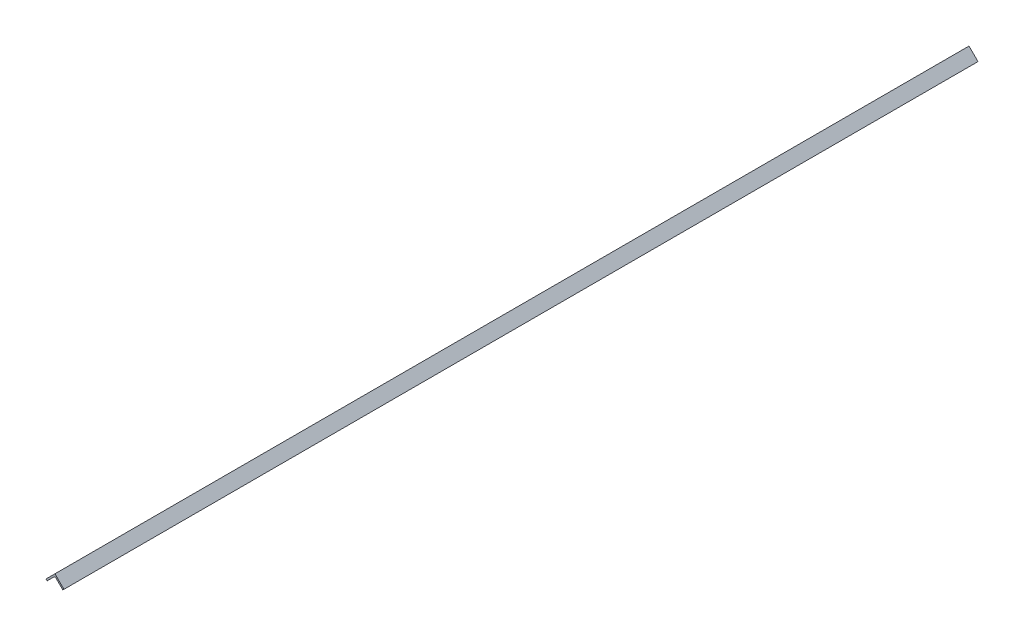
ISO-10303-21;
HEADER;
FILE_DESCRIPTION(('STEP AP214'),'2;1');
FILE_NAME('part.step','',(''),(''),'','','');
FILE_SCHEMA(('AUTOMOTIVE_DESIGN { 1 0 10303 214 1 1 1 1 }'));
ENDSEC;
DATA;
#1=APPLICATION_CONTEXT('core data for automotive mechanical design processes');
#2=APPLICATION_PROTOCOL_DEFINITION('international standard','automotive_design',2000,#1);
#3=PRODUCT_CONTEXT('',#1,'mechanical');
#4=PRODUCT('Part','Part','',(#3));
#5=PRODUCT_RELATED_PRODUCT_CATEGORY('part','',(#4));
#6=PRODUCT_DEFINITION_FORMATION('','',#4);
#7=PRODUCT_DEFINITION_CONTEXT('part definition',#1,'design');
#8=PRODUCT_DEFINITION('design','',#6,#7);
#9=PRODUCT_DEFINITION_SHAPE('','',#8);
#10=(LENGTH_UNIT() NAMED_UNIT(*) SI_UNIT(.MILLI.,.METRE.));
#11=(NAMED_UNIT(*) PLANE_ANGLE_UNIT() SI_UNIT($,.RADIAN.));
#12=(NAMED_UNIT(*) SI_UNIT($,.STERADIAN.) SOLID_ANGLE_UNIT());
#13=UNCERTAINTY_MEASURE_WITH_UNIT(LENGTH_MEASURE(1.E-05),#10,'distance_accuracy_value','');
#14=(GEOMETRIC_REPRESENTATION_CONTEXT(3) GLOBAL_UNCERTAINTY_ASSIGNED_CONTEXT((#13)) GLOBAL_UNIT_ASSIGNED_CONTEXT((#10,
#11,#12)) REPRESENTATION_CONTEXT('',''));
#15=CARTESIAN_POINT('',(0.,0.,0.));
#16=DIRECTION('',(0.,0.,1.));
#17=DIRECTION('',(1.,0.,0.));
#18=AXIS2_PLACEMENT_3D('',#15,#16,#17);
#19=CARTESIAN_POINT('',(0.,0.,-1828.8));
#20=DIRECTION('',(-0.707106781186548,0.707106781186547,0.));
#21=DIRECTION('',(-0.707106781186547,-0.707106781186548,0.));
#22=AXIS2_PLACEMENT_3D('',#19,#20,#21);
#23=PLANE('',#22);
#24=DIRECTION('',(-0.707106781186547,-0.707106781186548,0.));
#25=VECTOR('',#24,1.);
#26=CARTESIAN_POINT('',(0.,0.,0.));
#27=LINE('',#26,#25);
#28=CARTESIAN_POINT('',(0.,0.,0.));
#29=VERTEX_POINT('',#28);
#30=CARTESIAN_POINT('',(-17.9605122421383,-17.9605122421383,0.));
#31=VERTEX_POINT('',#30);
#32=EDGE_CURVE('E124',#29,#31,#27,.T.);
#33=ORIENTED_EDGE('',*,*,#32,.F.);
#34=DIRECTION('',(0.,0.,1.));
#35=VECTOR('',#34,1.);
#36=CARTESIAN_POINT('',(0.,0.,-1828.8));
#37=LINE('',#36,#35);
#38=CARTESIAN_POINT('',(0.,0.,-1828.8));
#39=VERTEX_POINT('',#38);
#40=EDGE_CURVE('E11',#39,#29,#37,.T.);
#41=ORIENTED_EDGE('',*,*,#40,.F.);
#42=DIRECTION('',(-0.707106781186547,-0.707106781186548,0.));
#43=VECTOR('',#42,1.);
#44=CARTESIAN_POINT('',(0.,0.,-1828.8));
#45=LINE('',#44,#43);
#46=CARTESIAN_POINT('',(-17.9605122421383,-17.9605122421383,-1828.8));
#47=VERTEX_POINT('',#46);
#48=EDGE_CURVE('E141',#39,#47,#45,.T.);
#49=ORIENTED_EDGE('',*,*,#48,.T.);
#50=DIRECTION('',(0.,0.,1.));
#51=VECTOR('',#50,1.);
#52=CARTESIAN_POINT('',(-17.9605122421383,-17.9605122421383,-1828.8));
#53=LINE('',#52,#51);
#54=EDGE_CURVE('E36',#47,#31,#53,.T.);
#55=ORIENTED_EDGE('',*,*,#54,.T.);
#56=EDGE_LOOP('',(#33,#41,#49,#55));
#57=FACE_BOUND('',#56,.T.);
#58=ADVANCED_FACE('F33',(#57),#23,.T.);
#59=CARTESIAN_POINT('',(0.,0.,-1828.8));
#60=DIRECTION('',(0.707106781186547,0.707106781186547,0.));
#61=DIRECTION('',(-0.707106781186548,0.707106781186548,0.));
#62=AXIS2_PLACEMENT_3D('',#59,#60,#61);
#63=PLANE('',#62);
#64=DIRECTION('',(-0.707106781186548,0.707106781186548,0.));
#65=VECTOR('',#64,1.);
#66=CARTESIAN_POINT('',(0.,0.,0.));
#67=LINE('',#66,#65);
#68=CARTESIAN_POINT('',(17.9605122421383,-17.9605122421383,0.));
#69=VERTEX_POINT('',#68);
#70=EDGE_CURVE('E139',#69,#29,#67,.T.);
#71=ORIENTED_EDGE('',*,*,#70,.F.);
#72=DIRECTION('',(0.,0.,1.));
#73=VECTOR('',#72,1.);
#74=CARTESIAN_POINT('',(17.9605122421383,-17.9605122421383,-1828.8));
#75=LINE('',#74,#73);
#76=CARTESIAN_POINT('',(17.9605122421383,-17.9605122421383,-1828.8));
#77=VERTEX_POINT('',#76);
#78=EDGE_CURVE('E42',#77,#69,#75,.T.);
#79=ORIENTED_EDGE('',*,*,#78,.F.);
#80=DIRECTION('',(-0.707106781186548,0.707106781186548,0.));
#81=VECTOR('',#80,1.);
#82=CARTESIAN_POINT('',(0.,0.,-1828.8));
#83=LINE('',#82,#81);
#84=EDGE_CURVE('E114',#77,#39,#83,.T.);
#85=ORIENTED_EDGE('',*,*,#84,.T.);
#86=ORIENTED_EDGE('',*,*,#40,.T.);
#87=EDGE_LOOP('',(#71,#79,#85,#86));
#88=FACE_BOUND('',#87,.T.);
#89=ADVANCED_FACE('F151',(#88),#63,.T.);
#90=CARTESIAN_POINT('',(15.715448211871,-20.2055762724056,-1828.8));
#91=DIRECTION('',(0.707106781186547,-0.707106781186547,0.));
#92=DIRECTION('',(0.707106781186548,0.707106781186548,0.));
#93=AXIS2_PLACEMENT_3D('',#90,#91,#92);
#94=PLANE('',#93);
#95=DIRECTION('',(0.707106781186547,0.707106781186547,0.));
#96=VECTOR('',#95,1.);
#97=CARTESIAN_POINT('',(15.715448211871,-20.2055762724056,0.));
#98=LINE('',#97,#96);
#99=CARTESIAN_POINT('',(15.715448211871,-20.2055762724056,0.));
#100=VERTEX_POINT('',#99);
#101=EDGE_CURVE('E101',#100,#69,#98,.T.);
#102=ORIENTED_EDGE('',*,*,#101,.F.);
#103=DIRECTION('',(0.,0.,1.));
#104=VECTOR('',#103,1.);
#105=CARTESIAN_POINT('',(15.715448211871,-20.2055762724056,-1828.8));
#106=LINE('',#105,#104);
#107=CARTESIAN_POINT('',(15.715448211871,-20.2055762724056,-1828.8));
#108=VERTEX_POINT('',#107);
#109=EDGE_CURVE('E96',#108,#100,#106,.T.);
#110=ORIENTED_EDGE('',*,*,#109,.F.);
#111=DIRECTION('',(0.707106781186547,0.707106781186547,0.));
#112=VECTOR('',#111,1.);
#113=CARTESIAN_POINT('',(15.715448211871,-20.2055762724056,-1828.8));
#114=LINE('',#113,#112);
#115=EDGE_CURVE('E99',#108,#77,#114,.T.);
#116=ORIENTED_EDGE('',*,*,#115,.T.);
#117=ORIENTED_EDGE('',*,*,#78,.T.);
#118=EDGE_LOOP('',(#102,#110,#116,#117));
#119=FACE_BOUND('',#118,.T.);
#120=ADVANCED_FACE('F98',(#119),#94,.T.);
#121=CARTESIAN_POINT('',(1.79605122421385,-6.28617928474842,-1828.8));
#122=DIRECTION('',(-0.707106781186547,-0.707106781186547,0.));
#123=DIRECTION('',(0.707106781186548,-0.707106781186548,0.));
#124=AXIS2_PLACEMENT_3D('',#121,#122,#123);
#125=PLANE('',#124);
#126=DIRECTION('',(0.707106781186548,-0.707106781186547,0.));
#127=VECTOR('',#126,1.);
#128=CARTESIAN_POINT('',(1.79605122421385,-6.28617928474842,0.));
#129=LINE('',#128,#127);
#130=CARTESIAN_POINT('',(1.79605122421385,-6.28617928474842,0.));
#131=VERTEX_POINT('',#130);
#132=EDGE_CURVE('E136',#131,#100,#129,.T.);
#133=ORIENTED_EDGE('',*,*,#132,.F.);
#134=DIRECTION('',(0.,0.,1.));
#135=VECTOR('',#134,1.);
#136=CARTESIAN_POINT('',(1.79605122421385,-6.28617928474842,-1828.8));
#137=LINE('',#136,#135);
#138=CARTESIAN_POINT('',(1.79605122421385,-6.28617928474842,-1828.8));
#139=VERTEX_POINT('',#138);
#140=EDGE_CURVE('E106',#139,#131,#137,.T.);
#141=ORIENTED_EDGE('',*,*,#140,.F.);
#142=DIRECTION('',(0.707106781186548,-0.707106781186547,0.));
#143=VECTOR('',#142,1.);
#144=CARTESIAN_POINT('',(1.79605122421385,-6.28617928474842,-1828.8));
#145=LINE('',#144,#143);
#146=EDGE_CURVE('E112',#139,#108,#145,.T.);
#147=ORIENTED_EDGE('',*,*,#146,.T.);
#148=ORIENTED_EDGE('',*,*,#109,.T.);
#149=EDGE_LOOP('',(#133,#141,#147,#148));
#150=FACE_BOUND('',#149,.T.);
#151=ADVANCED_FACE('F116',(#150),#125,.T.);
#152=CARTESIAN_POINT('',(0.,-8.08223050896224,-1828.8));
#153=DIRECTION('',(0.,0.,1.));
#154=DIRECTION('',(1.,0.,0.));
#155=AXIS2_PLACEMENT_3D('',#152,#153,#154);
#156=CYLINDRICAL_SURFACE('',#155,2.54);
#157=CARTESIAN_POINT('',(0.,-8.08223050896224,0.));
#158=DIRECTION('',(0.,0.,-1.));
#159=DIRECTION('',(-1.,0.,0.));
#160=AXIS2_PLACEMENT_3D('',#157,#158,#159);
#161=CIRCLE('',#160,2.54);
#162=CARTESIAN_POINT('',(-1.79605122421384,-6.28617928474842,0.));
#163=VERTEX_POINT('',#162);
#164=EDGE_CURVE('E133',#163,#131,#161,.T.);
#165=ORIENTED_EDGE('',*,*,#164,.F.);
#166=DIRECTION('',(0.,0.,1.));
#167=VECTOR('',#166,1.);
#168=CARTESIAN_POINT('',(-1.79605122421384,-6.28617928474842,-1828.8));
#169=LINE('',#168,#167);
#170=CARTESIAN_POINT('',(-1.79605122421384,-6.28617928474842,-1828.8));
#171=VERTEX_POINT('',#170);
#172=EDGE_CURVE('E145',#171,#163,#169,.T.);
#173=ORIENTED_EDGE('',*,*,#172,.F.);
#174=CARTESIAN_POINT('',(0.,-8.08223050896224,-1828.8));
#175=DIRECTION('',(0.,0.,-1.));
#176=DIRECTION('',(-1.,0.,0.));
#177=AXIS2_PLACEMENT_3D('',#174,#175,#176);
#178=CIRCLE('',#177,2.54);
#179=EDGE_CURVE('E117',#171,#139,#178,.T.);
#180=ORIENTED_EDGE('',*,*,#179,.T.);
#181=ORIENTED_EDGE('',*,*,#140,.T.);
#182=EDGE_LOOP('',(#165,#173,#180,#181));
#183=FACE_BOUND('',#182,.T.);
#184=ADVANCED_FACE('F164',(#183),#156,.F.);
#185=CARTESIAN_POINT('',(-15.715448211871,-20.2055762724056,-1828.8));
#186=DIRECTION('',(0.707106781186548,-0.707106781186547,0.));
#187=DIRECTION('',(0.707106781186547,0.707106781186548,0.));
#188=AXIS2_PLACEMENT_3D('',#185,#186,#187);
#189=PLANE('',#188);
#190=DIRECTION('',(0.707106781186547,0.707106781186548,0.));
#191=VECTOR('',#190,1.);
#192=CARTESIAN_POINT('',(-15.715448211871,-20.2055762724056,0.));
#193=LINE('',#192,#191);
#194=CARTESIAN_POINT('',(-15.715448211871,-20.2055762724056,0.));
#195=VERTEX_POINT('',#194);
#196=EDGE_CURVE('E130',#195,#163,#193,.T.);
#197=ORIENTED_EDGE('',*,*,#196,.F.);
#198=DIRECTION('',(0.,0.,1.));
#199=VECTOR('',#198,1.);
#200=CARTESIAN_POINT('',(-15.715448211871,-20.2055762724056,-1828.8));
#201=LINE('',#200,#199);
#202=CARTESIAN_POINT('',(-15.715448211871,-20.2055762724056,-1828.8));
#203=VERTEX_POINT('',#202);
#204=EDGE_CURVE('E146',#203,#195,#201,.T.);
#205=ORIENTED_EDGE('',*,*,#204,.F.);
#206=DIRECTION('',(0.707106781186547,0.707106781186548,0.));
#207=VECTOR('',#206,1.);
#208=CARTESIAN_POINT('',(-15.715448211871,-20.2055762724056,-1828.8));
#209=LINE('',#208,#207);
#210=EDGE_CURVE('E119',#203,#171,#209,.T.);
#211=ORIENTED_EDGE('',*,*,#210,.T.);
#212=ORIENTED_EDGE('',*,*,#172,.T.);
#213=EDGE_LOOP('',(#197,#205,#211,#212));
#214=FACE_BOUND('',#213,.T.);
#215=ADVANCED_FACE('F167',(#214),#189,.T.);
#216=CARTESIAN_POINT('',(-17.9605122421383,-17.9605122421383,-1828.8));
#217=DIRECTION('',(-0.707106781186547,-0.707106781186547,0.));
#218=DIRECTION('',(0.707106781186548,-0.707106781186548,0.));
#219=AXIS2_PLACEMENT_3D('',#216,#217,#218);
#220=PLANE('',#219);
#221=DIRECTION('',(0.707106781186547,-0.707106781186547,0.));
#222=VECTOR('',#221,1.);
#223=CARTESIAN_POINT('',(-17.9605122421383,-17.9605122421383,0.));
#224=LINE('',#223,#222);
#225=EDGE_CURVE('E127',#31,#195,#224,.T.);
#226=ORIENTED_EDGE('',*,*,#225,.F.);
#227=ORIENTED_EDGE('',*,*,#54,.F.);
#228=DIRECTION('',(0.707106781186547,-0.707106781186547,0.));
#229=VECTOR('',#228,1.);
#230=CARTESIAN_POINT('',(-17.9605122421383,-17.9605122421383,-1828.8));
#231=LINE('',#230,#229);
#232=EDGE_CURVE('E229',#47,#203,#231,.T.);
#233=ORIENTED_EDGE('',*,*,#232,.T.);
#234=ORIENTED_EDGE('',*,*,#204,.T.);
#235=EDGE_LOOP('',(#226,#227,#233,#234));
#236=FACE_BOUND('',#235,.T.);
#237=ADVANCED_FACE('F148',(#236),#220,.T.);
#238=CARTESIAN_POINT('',(0.,-8.08223050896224,-1828.8));
#239=DIRECTION('',(0.,0.,-1.));
#240=DIRECTION('',(-1.,0.,0.));
#241=AXIS2_PLACEMENT_3D('',#238,#239,#240);
#242=PLANE('',#241);
#243=ORIENTED_EDGE('',*,*,#48,.F.);
#244=ORIENTED_EDGE('',*,*,#84,.F.);
#245=ORIENTED_EDGE('',*,*,#115,.F.);
#246=ORIENTED_EDGE('',*,*,#146,.F.);
#247=ORIENTED_EDGE('',*,*,#179,.F.);
#248=ORIENTED_EDGE('',*,*,#210,.F.);
#249=ORIENTED_EDGE('',*,*,#232,.F.);
#250=EDGE_LOOP('',(#243,#244,#245,#246,#247,#248,#249));
#251=FACE_BOUND('',#250,.T.);
#252=ADVANCED_FACE('F110',(#251),#242,.T.);
#253=CARTESIAN_POINT('',(0.,-8.08223050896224,0.));
#254=DIRECTION('',(0.,0.,-1.));
#255=DIRECTION('',(-1.,0.,0.));
#256=AXIS2_PLACEMENT_3D('',#253,#254,#255);
#257=PLANE('',#256);
#258=ORIENTED_EDGE('',*,*,#32,.T.);
#259=ORIENTED_EDGE('',*,*,#225,.T.);
#260=ORIENTED_EDGE('',*,*,#196,.T.);
#261=ORIENTED_EDGE('',*,*,#164,.T.);
#262=ORIENTED_EDGE('',*,*,#132,.T.);
#263=ORIENTED_EDGE('',*,*,#101,.T.);
#264=ORIENTED_EDGE('',*,*,#70,.T.);
#265=EDGE_LOOP('',(#258,#259,#260,#261,#262,#263,#264));
#266=FACE_BOUND('',#265,.T.);
#267=ADVANCED_FACE('F150',(#266),#257,.F.);
#268=CLOSED_SHELL('',(#58,#89,#120,#151,#184,#215,#237,#252,#267));
#269=MANIFOLD_SOLID_BREP('B2',#268);
#270=ADVANCED_BREP_SHAPE_REPRESENTATION('',(#18,#269),#14);
#271=SHAPE_DEFINITION_REPRESENTATION(#9,#270);
ENDSEC;
END-ISO-10303-21;
